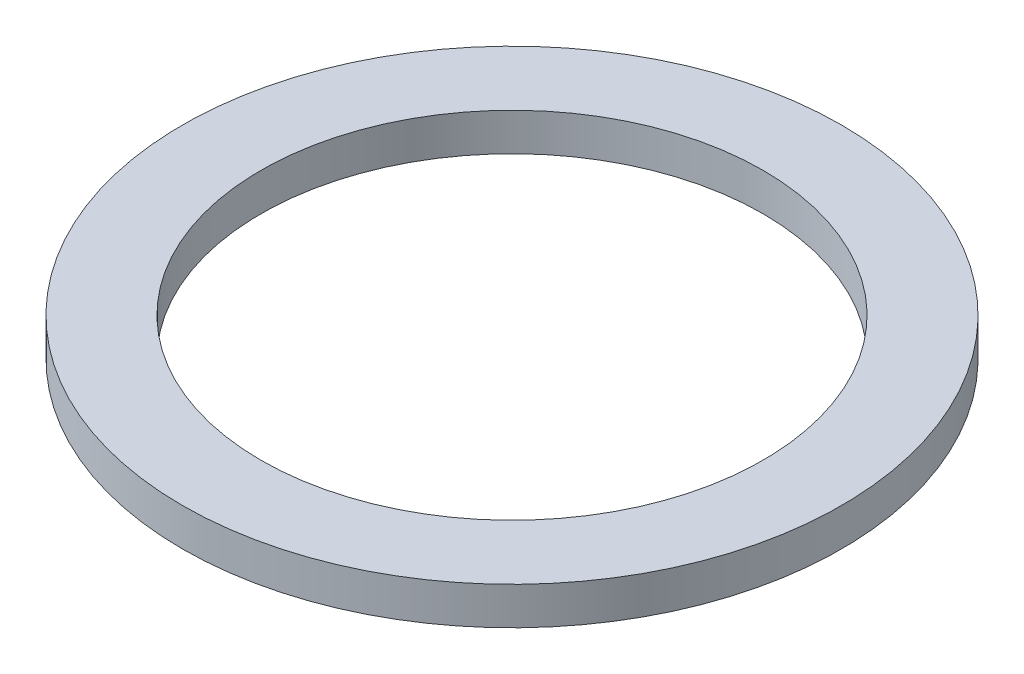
from build123d import *

# Parameters (mm, degrees)
SKETCH_1_R      = 52.5
SKETCH_1_R_2    = 40
EXTRUDE_1_DEPTH = 6


with BuildPart() as part:
    # Sketch 1 → Extrude 1 (new body)
    with BuildSketch(Plane(origin=(0, 0, 0), x_dir=(1, 0, 0), z_dir=(0, 1, 0))):
        with Locations(Location((0, 0, 0), (0, 0, 270))):
            Circle(SKETCH_1_R)
        with Locations(Location((0, 0, 0), (0, 0, 270))):
            Circle(SKETCH_1_R_2, mode=Mode.SUBTRACT)
    extrude(amount=EXTRUDE_1_DEPTH)


solid = part.part
